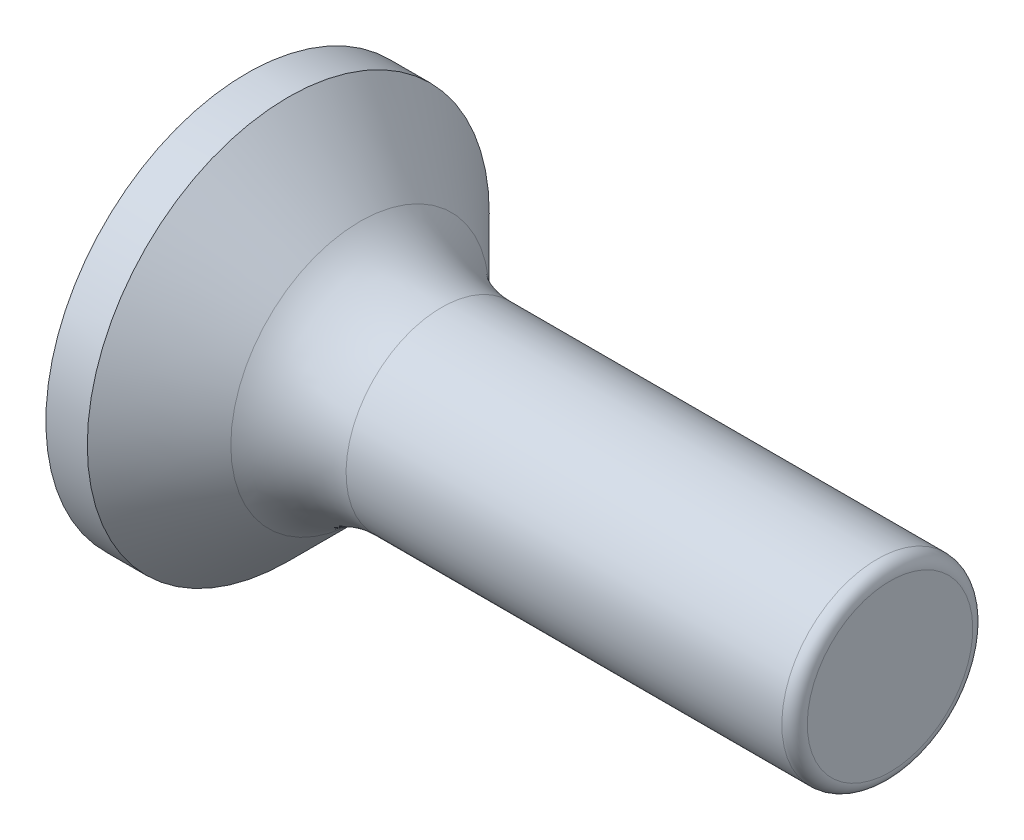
ISO-10303-21;
HEADER;
FILE_DESCRIPTION(('STEP AP214'),'2;1');
FILE_NAME('part.step','',(''),(''),'','','');
FILE_SCHEMA(('AUTOMOTIVE_DESIGN { 1 0 10303 214 1 1 1 1 }'));
ENDSEC;
DATA;
#1=APPLICATION_CONTEXT('core data for automotive mechanical design processes');
#2=APPLICATION_PROTOCOL_DEFINITION('international standard','automotive_design',2000,#1);
#3=PRODUCT_CONTEXT('',#1,'mechanical');
#4=PRODUCT('Part','Part','',(#3));
#5=PRODUCT_RELATED_PRODUCT_CATEGORY('part','',(#4));
#6=PRODUCT_DEFINITION_FORMATION('','',#4);
#7=PRODUCT_DEFINITION_CONTEXT('part definition',#1,'design');
#8=PRODUCT_DEFINITION('design','',#6,#7);
#9=PRODUCT_DEFINITION_SHAPE('','',#8);
#10=(LENGTH_UNIT() NAMED_UNIT(*) SI_UNIT(.MILLI.,.METRE.));
#11=(NAMED_UNIT(*) PLANE_ANGLE_UNIT() SI_UNIT($,.RADIAN.));
#12=(NAMED_UNIT(*) SI_UNIT($,.STERADIAN.) SOLID_ANGLE_UNIT());
#13=UNCERTAINTY_MEASURE_WITH_UNIT(LENGTH_MEASURE(1.E-05),#10,'distance_accuracy_value','');
#14=(GEOMETRIC_REPRESENTATION_CONTEXT(3) GLOBAL_UNCERTAINTY_ASSIGNED_CONTEXT((#13)) GLOBAL_UNIT_ASSIGNED_CONTEXT((#10,
#11,#12)) REPRESENTATION_CONTEXT('',''));
#15=CARTESIAN_POINT('',(0.,0.,0.));
#16=DIRECTION('',(0.,0.,1.));
#17=DIRECTION('',(1.,0.,0.));
#18=AXIS2_PLACEMENT_3D('',#15,#16,#17);
#19=CARTESIAN_POINT('',(22.8891304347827,0.,0.));
#20=DIRECTION('',(-1.,0.,0.));
#21=DIRECTION('',(0.,1.,0.));
#22=AXIS2_PLACEMENT_3D('',#19,#20,#21);
#23=SPHERICAL_SURFACE('',#22,22.8891304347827);
#24=CARTESIAN_POINT('',(2.29999999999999,0.,0.));
#25=DIRECTION('',(-1.,0.,0.));
#26=DIRECTION('',(0.,-1.,0.));
#27=AXIS2_PLACEMENT_3D('',#24,#25,#26);
#28=CIRCLE('',#27,10.);
#29=CARTESIAN_POINT('',(2.29999999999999,-10.,0.));
#30=VERTEX_POINT('',#29);
#31=EDGE_CURVE('E248',#30,#30,#28,.T.);
#32=ORIENTED_EDGE('',*,*,#31,.T.);
#33=EDGE_LOOP('',(#32));
#34=FACE_BOUND('',#33,.T.);
#35=CARTESIAN_POINT('',(22.8891304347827,0.,-1.01));
#36=DIRECTION('',(0.,0.,1.));
#37=DIRECTION('',(0.,-1.,0.));
#38=AXIS2_PLACEMENT_3D('',#35,#36,#37);
#39=CIRCLE('',#38,22.8668360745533);
#40=CARTESIAN_POINT('',(0.482999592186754,4.56700040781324,-1.01));
#41=VERTEX_POINT('',#40);
#42=CARTESIAN_POINT('',(0.0446104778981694,1.01,-1.01));
#43=VERTEX_POINT('',#42);
#44=EDGE_CURVE('E167',#41,#43,#39,.T.);
#45=ORIENTED_EDGE('',*,*,#44,.F.);
#46=CARTESIAN_POINT('',(13.9695652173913,-8.91956521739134,0.));
#47=DIRECTION('',(-0.707106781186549,-0.707106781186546,0.));
#48=DIRECTION('',(0.707106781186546,-0.707106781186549,0.));
#49=AXIS2_PLACEMENT_3D('',#46,#47,#48);
#50=CIRCLE('',#49,19.0996074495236);
#51=CARTESIAN_POINT('',(0.482999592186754,4.56700040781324,1.01));
#52=VERTEX_POINT('',#51);
#53=EDGE_CURVE('E188',#52,#41,#50,.T.);
#54=ORIENTED_EDGE('',*,*,#53,.F.);
#55=CARTESIAN_POINT('',(22.8891304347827,0.,1.01));
#56=DIRECTION('',(0.,0.,-1.));
#57=DIRECTION('',(0.,1.,0.));
#58=AXIS2_PLACEMENT_3D('',#55,#56,#57);
#59=CIRCLE('',#58,22.8668360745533);
#60=CARTESIAN_POINT('',(0.0446104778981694,1.01,1.01));
#61=VERTEX_POINT('',#60);
#62=EDGE_CURVE('E171',#61,#52,#59,.T.);
#63=ORIENTED_EDGE('',*,*,#62,.F.);
#64=CARTESIAN_POINT('',(22.8891304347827,1.01,0.));
#65=DIRECTION('',(0.,-1.,0.));
#66=DIRECTION('',(0.,0.,-1.));
#67=AXIS2_PLACEMENT_3D('',#64,#65,#66);
#68=CIRCLE('',#67,22.8668360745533);
#69=CARTESIAN_POINT('',(0.482999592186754,1.01,4.56700040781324));
#70=VERTEX_POINT('',#69);
#71=EDGE_CURVE('E163',#70,#61,#68,.T.);
#72=ORIENTED_EDGE('',*,*,#71,.F.);
#73=CARTESIAN_POINT('',(13.9695652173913,0.,-8.91956521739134));
#74=DIRECTION('',(-0.707106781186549,0.,-0.707106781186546));
#75=DIRECTION('',(-0.707106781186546,0.,0.707106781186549));
#76=AXIS2_PLACEMENT_3D('',#73,#74,#75);
#77=CIRCLE('',#76,19.0996074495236);
#78=CARTESIAN_POINT('',(0.482999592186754,-1.01,4.56700040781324));
#79=VERTEX_POINT('',#78);
#80=EDGE_CURVE('E161',#79,#70,#77,.T.);
#81=ORIENTED_EDGE('',*,*,#80,.F.);
#82=CARTESIAN_POINT('',(22.8891304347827,-1.01,0.));
#83=DIRECTION('',(0.,1.,0.));
#84=DIRECTION('',(0.,0.,1.));
#85=AXIS2_PLACEMENT_3D('',#82,#83,#84);
#86=CIRCLE('',#85,22.8668360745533);
#87=CARTESIAN_POINT('',(0.0446104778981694,-1.01,1.01));
#88=VERTEX_POINT('',#87);
#89=EDGE_CURVE('E146',#88,#79,#86,.T.);
#90=ORIENTED_EDGE('',*,*,#89,.F.);
#91=CARTESIAN_POINT('',(22.8891304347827,0.,1.01));
#92=DIRECTION('',(0.,0.,-1.));
#93=DIRECTION('',(0.,1.,0.));
#94=AXIS2_PLACEMENT_3D('',#91,#92,#93);
#95=CIRCLE('',#94,22.8668360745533);
#96=CARTESIAN_POINT('',(0.482999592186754,-4.56700040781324,1.01));
#97=VERTEX_POINT('',#96);
#98=EDGE_CURVE('E136',#97,#88,#95,.T.);
#99=ORIENTED_EDGE('',*,*,#98,.F.);
#100=CARTESIAN_POINT('',(13.9695652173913,8.91956521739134,0.));
#101=DIRECTION('',(-0.707106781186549,0.707106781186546,0.));
#102=DIRECTION('',(-0.707106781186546,-0.707106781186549,0.));
#103=AXIS2_PLACEMENT_3D('',#100,#101,#102);
#104=CIRCLE('',#103,19.0996074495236);
#105=CARTESIAN_POINT('',(0.482999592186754,-4.56700040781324,-1.01));
#106=VERTEX_POINT('',#105);
#107=EDGE_CURVE('E147',#106,#97,#104,.T.);
#108=ORIENTED_EDGE('',*,*,#107,.F.);
#109=CARTESIAN_POINT('',(22.8891304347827,0.,-1.01));
#110=DIRECTION('',(0.,0.,1.));
#111=DIRECTION('',(0.,-1.,0.));
#112=AXIS2_PLACEMENT_3D('',#109,#110,#111);
#113=CIRCLE('',#112,22.8668360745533);
#114=CARTESIAN_POINT('',(0.0446104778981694,-1.01,-1.01));
#115=VERTEX_POINT('',#114);
#116=EDGE_CURVE('E178',#115,#106,#113,.T.);
#117=ORIENTED_EDGE('',*,*,#116,.F.);
#118=CARTESIAN_POINT('',(22.8891304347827,-1.01,0.));
#119=DIRECTION('',(0.,1.,0.));
#120=DIRECTION('',(0.,0.,1.));
#121=AXIS2_PLACEMENT_3D('',#118,#119,#120);
#122=CIRCLE('',#121,22.8668360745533);
#123=CARTESIAN_POINT('',(0.482999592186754,-1.01,-4.56700040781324));
#124=VERTEX_POINT('',#123);
#125=EDGE_CURVE('E176',#124,#115,#122,.T.);
#126=ORIENTED_EDGE('',*,*,#125,.F.);
#127=CARTESIAN_POINT('',(13.9695652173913,0.,8.91956521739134));
#128=DIRECTION('',(-0.707106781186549,0.,0.707106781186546));
#129=DIRECTION('',(0.707106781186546,0.,0.707106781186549));
#130=AXIS2_PLACEMENT_3D('',#127,#128,#129);
#131=CIRCLE('',#130,19.0996074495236);
#132=CARTESIAN_POINT('',(0.482999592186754,1.01,-4.56700040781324));
#133=VERTEX_POINT('',#132);
#134=EDGE_CURVE('E174',#133,#124,#131,.T.);
#135=ORIENTED_EDGE('',*,*,#134,.F.);
#136=CARTESIAN_POINT('',(22.8891304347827,1.01,0.));
#137=DIRECTION('',(0.,-1.,0.));
#138=DIRECTION('',(0.,0.,-1.));
#139=AXIS2_PLACEMENT_3D('',#136,#137,#138);
#140=CIRCLE('',#139,22.8668360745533);
#141=EDGE_CURVE('E172',#43,#133,#140,.T.);
#142=ORIENTED_EDGE('',*,*,#141,.F.);
#143=EDGE_LOOP('',(#45,#54,#63,#72,#81,#90,#99,#108,#117,#126,#135,#142));
#144=FACE_BOUND('',#143,.T.);
#145=ADVANCED_FACE('F43',(#34,#144),#23,.T.);
#146=CARTESIAN_POINT('',(11.9851256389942,0.,0.));
#147=DIRECTION('',(-1.,0.,0.));
#148=DIRECTION('',(0.,-1.,0.));
#149=AXIS2_PLACEMENT_3D('',#146,#147,#148);
#150=TOROIDAL_SURFACE('',#149,10.48406053,5.73406053);
#151=CARTESIAN_POINT('',(7.93053255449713,0.,0.));
#152=DIRECTION('',(-1.,0.,0.));
#153=DIRECTION('',(0.,-1.,0.));
#154=AXIS2_PLACEMENT_3D('',#151,#152,#153);
#155=CIRCLE('',#154,6.42946744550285);
#156=CARTESIAN_POINT('',(7.93053255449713,-6.42946744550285,0.));
#157=VERTEX_POINT('',#156);
#158=EDGE_CURVE('E175',#157,#157,#155,.T.);
#159=ORIENTED_EDGE('',*,*,#158,.F.);
#160=EDGE_LOOP('',(#159));
#161=FACE_BOUND('',#160,.T.);
#162=CARTESIAN_POINT('',(11.9851256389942,0.,0.));
#163=DIRECTION('',(-1.,0.,0.));
#164=DIRECTION('',(0.,-1.,0.));
#165=AXIS2_PLACEMENT_3D('',#162,#163,#164);
#166=CIRCLE('',#165,4.74999999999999);
#167=CARTESIAN_POINT('',(11.9851256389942,-4.74999999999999,0.));
#168=VERTEX_POINT('',#167);
#169=EDGE_CURVE('E200',#168,#168,#166,.T.);
#170=ORIENTED_EDGE('',*,*,#169,.T.);
#171=EDGE_LOOP('',(#170));
#172=FACE_BOUND('',#171,.T.);
#173=ADVANCED_FACE('F288',(#161,#172),#150,.F.);
#174=CARTESIAN_POINT('',(7.93053255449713,0.,0.));
#175=DIRECTION('',(-1.,0.,0.));
#176=DIRECTION('',(0.,-1.,0.));
#177=AXIS2_PLACEMENT_3D('',#174,#175,#176);
#178=CONICAL_SURFACE('',#177,6.42946744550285,0.785398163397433);
#179=CARTESIAN_POINT('',(4.35999999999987,0.,0.));
#180=DIRECTION('',(-1.,0.,0.));
#181=DIRECTION('',(0.,-1.,0.));
#182=AXIS2_PLACEMENT_3D('',#179,#180,#181);
#183=CIRCLE('',#182,10.);
#184=CARTESIAN_POINT('',(4.35999999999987,-10.,0.));
#185=VERTEX_POINT('',#184);
#186=EDGE_CURVE('E251',#185,#185,#183,.T.);
#187=ORIENTED_EDGE('',*,*,#186,.F.);
#188=EDGE_LOOP('',(#187));
#189=FACE_BOUND('',#188,.T.);
#190=ORIENTED_EDGE('',*,*,#158,.T.);
#191=EDGE_LOOP('',(#190));
#192=FACE_BOUND('',#191,.T.);
#193=ADVANCED_FACE('F296',(#189,#192),#178,.T.);
#194=CARTESIAN_POINT('',(-18.0938637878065,0.,0.));
#195=DIRECTION('',(-1.,0.,0.));
#196=DIRECTION('',(0.,-1.,0.));
#197=AXIS2_PLACEMENT_3D('',#194,#195,#196);
#198=CYLINDRICAL_SURFACE('',#197,10.);
#199=ORIENTED_EDGE('',*,*,#31,.F.);
#200=EDGE_LOOP('',(#199));
#201=FACE_BOUND('',#200,.T.);
#202=ORIENTED_EDGE('',*,*,#186,.T.);
#203=EDGE_LOOP('',(#202));
#204=FACE_BOUND('',#203,.T.);
#205=ADVANCED_FACE('F303',(#201,#204),#198,.T.);
#206=CARTESIAN_POINT('',(34.3,0.,0.));
#207=DIRECTION('',(-1.,0.,0.));
#208=DIRECTION('',(0.,-1.,0.));
#209=AXIS2_PLACEMENT_3D('',#206,#207,#208);
#210=PLANE('',#209);
#211=CARTESIAN_POINT('',(34.3,0.,0.));
#212=DIRECTION('',(-1.,0.,0.));
#213=DIRECTION('',(0.,-1.,0.));
#214=AXIS2_PLACEMENT_3D('',#211,#212,#213);
#215=CIRCLE('',#214,4.11666666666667);
#216=CARTESIAN_POINT('',(34.3,-4.11666666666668,0.));
#217=VERTEX_POINT('',#216);
#218=EDGE_CURVE('E11',#217,#217,#215,.F.);
#219=ORIENTED_EDGE('',*,*,#218,.T.);
#220=EDGE_LOOP('',(#219));
#221=FACE_BOUND('',#220,.T.);
#222=ADVANCED_FACE('F301',(#221),#210,.F.);
#223=CARTESIAN_POINT('',(-18.0938637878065,0.,0.));
#224=DIRECTION('',(-1.,0.,0.));
#225=DIRECTION('',(0.,-1.,0.));
#226=AXIS2_PLACEMENT_3D('',#223,#224,#225);
#227=CYLINDRICAL_SURFACE('',#226,4.75);
#228=CARTESIAN_POINT('',(33.6666666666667,0.,0.));
#229=DIRECTION('',(-1.,0.,0.));
#230=DIRECTION('',(0.,-1.,0.));
#231=AXIS2_PLACEMENT_3D('',#228,#229,#230);
#232=CIRCLE('',#231,4.75);
#233=CARTESIAN_POINT('',(33.6666666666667,-4.75000000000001,0.));
#234=VERTEX_POINT('',#233);
#235=EDGE_CURVE('E52',#234,#234,#232,.T.);
#236=ORIENTED_EDGE('',*,*,#235,.T.);
#237=EDGE_LOOP('',(#236));
#238=FACE_BOUND('',#237,.T.);
#239=ORIENTED_EDGE('',*,*,#169,.F.);
#240=EDGE_LOOP('',(#239));
#241=FACE_BOUND('',#240,.T.);
#242=ADVANCED_FACE('F320',(#238,#241),#227,.T.);
#243=CARTESIAN_POINT('',(2.81526627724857,5.05,-1.01));
#244=DIRECTION('',(0.,0.,1.));
#245=DIRECTION('',(0.,-1.,0.));
#246=AXIS2_PLACEMENT_3D('',#243,#244,#245);
#247=PLANE('',#246);
#248=ORIENTED_EDGE('',*,*,#44,.T.);
#249=DIRECTION('',(-1.,0.,0.));
#250=VECTOR('',#249,1.);
#251=CARTESIAN_POINT('',(2.81526627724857,1.01,-1.01));
#252=LINE('',#251,#250);
#253=CARTESIAN_POINT('',(2.81526627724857,1.01,-1.01));
#254=VERTEX_POINT('',#253);
#255=EDGE_CURVE('E60',#254,#43,#252,.T.);
#256=ORIENTED_EDGE('',*,*,#255,.F.);
#257=DIRECTION('',(0.,1.,0.));
#258=VECTOR('',#257,1.);
#259=CARTESIAN_POINT('',(2.81526627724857,5.05,-1.01));
#260=LINE('',#259,#258);
#261=CARTESIAN_POINT('',(2.81526627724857,2.23473372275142,-1.01));
#262=VERTEX_POINT('',#261);
#263=EDGE_CURVE('E198',#254,#262,#260,.T.);
#264=ORIENTED_EDGE('',*,*,#263,.T.);
#265=DIRECTION('',(-0.707106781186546,0.707106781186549,0.));
#266=VECTOR('',#265,1.);
#267=CARTESIAN_POINT('',(0.,5.05,-1.01));
#268=LINE('',#267,#266);
#269=EDGE_CURVE('E193',#262,#41,#268,.T.);
#270=ORIENTED_EDGE('',*,*,#269,.T.);
#271=EDGE_LOOP('',(#248,#256,#264,#270));
#272=FACE_BOUND('',#271,.T.);
#273=ADVANCED_FACE('F223',(#272),#247,.T.);
#274=CARTESIAN_POINT('',(0.,5.05,0.));
#275=DIRECTION('',(-0.707106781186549,-0.707106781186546,0.));
#276=DIRECTION('',(0.707106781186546,-0.707106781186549,0.));
#277=AXIS2_PLACEMENT_3D('',#274,#275,#276);
#278=PLANE('',#277);
#279=ORIENTED_EDGE('',*,*,#53,.T.);
#280=ORIENTED_EDGE('',*,*,#269,.F.);
#281=DIRECTION('',(0.,0.,1.));
#282=VECTOR('',#281,1.);
#283=CARTESIAN_POINT('',(2.81526627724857,2.23473372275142,-1.01));
#284=LINE('',#283,#282);
#285=CARTESIAN_POINT('',(2.81526627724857,2.23473372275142,1.01));
#286=VERTEX_POINT('',#285);
#287=EDGE_CURVE('E195',#262,#286,#284,.T.);
#288=ORIENTED_EDGE('',*,*,#287,.T.);
#289=DIRECTION('',(-0.707106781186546,0.707106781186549,0.));
#290=VECTOR('',#289,1.);
#291=CARTESIAN_POINT('',(1.40763313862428,3.64236686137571,1.01));
#292=LINE('',#291,#290);
#293=EDGE_CURVE('E190',#286,#52,#292,.T.);
#294=ORIENTED_EDGE('',*,*,#293,.T.);
#295=EDGE_LOOP('',(#279,#280,#288,#294));
#296=FACE_BOUND('',#295,.T.);
#297=ADVANCED_FACE('F265',(#296),#278,.T.);
#298=CARTESIAN_POINT('',(2.81526627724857,5.05,1.01));
#299=DIRECTION('',(0.,0.,-1.));
#300=DIRECTION('',(0.,1.,0.));
#301=AXIS2_PLACEMENT_3D('',#298,#299,#300);
#302=PLANE('',#301);
#303=ORIENTED_EDGE('',*,*,#62,.T.);
#304=ORIENTED_EDGE('',*,*,#293,.F.);
#305=DIRECTION('',(0.,-1.,0.));
#306=VECTOR('',#305,1.);
#307=CARTESIAN_POINT('',(2.81526627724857,5.05,1.01));
#308=LINE('',#307,#306);
#309=CARTESIAN_POINT('',(2.81526627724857,1.01,1.01));
#310=VERTEX_POINT('',#309);
#311=EDGE_CURVE('E197',#286,#310,#308,.T.);
#312=ORIENTED_EDGE('',*,*,#311,.T.);
#313=DIRECTION('',(-1.,0.,0.));
#314=VECTOR('',#313,1.);
#315=CARTESIAN_POINT('',(2.81526627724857,1.01,1.01));
#316=LINE('',#315,#314);
#317=EDGE_CURVE('E194',#310,#61,#316,.T.);
#318=ORIENTED_EDGE('',*,*,#317,.T.);
#319=EDGE_LOOP('',(#303,#304,#312,#318));
#320=FACE_BOUND('',#319,.T.);
#321=ADVANCED_FACE('F260',(#320),#302,.T.);
#322=CARTESIAN_POINT('',(2.81526627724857,1.01,1.01));
#323=DIRECTION('',(0.,-1.,0.));
#324=DIRECTION('',(0.,0.,-1.));
#325=AXIS2_PLACEMENT_3D('',#322,#323,#324);
#326=PLANE('',#325);
#327=ORIENTED_EDGE('',*,*,#71,.T.);
#328=ORIENTED_EDGE('',*,*,#317,.F.);
#329=DIRECTION('',(0.,0.,1.));
#330=VECTOR('',#329,1.);
#331=CARTESIAN_POINT('',(2.81526627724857,1.01,1.01));
#332=LINE('',#331,#330);
#333=CARTESIAN_POINT('',(2.81526627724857,1.01,2.23473372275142));
#334=VERTEX_POINT('',#333);
#335=EDGE_CURVE('E206',#310,#334,#332,.T.);
#336=ORIENTED_EDGE('',*,*,#335,.T.);
#337=DIRECTION('',(-0.707106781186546,0.,0.707106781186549));
#338=VECTOR('',#337,1.);
#339=CARTESIAN_POINT('',(0.,1.01,5.05));
#340=LINE('',#339,#338);
#341=EDGE_CURVE('E203',#334,#70,#340,.T.);
#342=ORIENTED_EDGE('',*,*,#341,.T.);
#343=EDGE_LOOP('',(#327,#328,#336,#342));
#344=FACE_BOUND('',#343,.T.);
#345=ADVANCED_FACE('F313',(#344),#326,.T.);
#346=CARTESIAN_POINT('',(0.,0.,5.05));
#347=DIRECTION('',(-0.707106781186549,0.,-0.707106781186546));
#348=DIRECTION('',(-0.707106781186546,0.,0.707106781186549));
#349=AXIS2_PLACEMENT_3D('',#346,#347,#348);
#350=PLANE('',#349);
#351=ORIENTED_EDGE('',*,*,#80,.T.);
#352=ORIENTED_EDGE('',*,*,#341,.F.);
#353=DIRECTION('',(0.,-1.,0.));
#354=VECTOR('',#353,1.);
#355=CARTESIAN_POINT('',(2.81526627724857,-1.01,2.23473372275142));
#356=LINE('',#355,#354);
#357=CARTESIAN_POINT('',(2.81526627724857,-1.01,2.23473372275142));
#358=VERTEX_POINT('',#357);
#359=EDGE_CURVE('E204',#334,#358,#356,.T.);
#360=ORIENTED_EDGE('',*,*,#359,.T.);
#361=DIRECTION('',(-0.707106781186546,0.,0.707106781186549));
#362=VECTOR('',#361,1.);
#363=CARTESIAN_POINT('',(3.42763313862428,-1.01,1.62236686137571));
#364=LINE('',#363,#362);
#365=EDGE_CURVE('E156',#358,#79,#364,.T.);
#366=ORIENTED_EDGE('',*,*,#365,.T.);
#367=EDGE_LOOP('',(#351,#352,#360,#366));
#368=FACE_BOUND('',#367,.T.);
#369=ADVANCED_FACE('F311',(#368),#350,.T.);
#370=CARTESIAN_POINT('',(2.81526627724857,-1.01,1.01));
#371=DIRECTION('',(0.,1.,0.));
#372=DIRECTION('',(0.,0.,1.));
#373=AXIS2_PLACEMENT_3D('',#370,#371,#372);
#374=PLANE('',#373);
#375=ORIENTED_EDGE('',*,*,#89,.T.);
#376=ORIENTED_EDGE('',*,*,#365,.F.);
#377=DIRECTION('',(0.,0.,-1.));
#378=VECTOR('',#377,1.);
#379=CARTESIAN_POINT('',(2.81526627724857,-1.01,1.01));
#380=LINE('',#379,#378);
#381=CARTESIAN_POINT('',(2.81526627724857,-1.01,1.01));
#382=VERTEX_POINT('',#381);
#383=EDGE_CURVE('E155',#358,#382,#380,.T.);
#384=ORIENTED_EDGE('',*,*,#383,.T.);
#385=DIRECTION('',(-1.,0.,0.));
#386=VECTOR('',#385,1.);
#387=CARTESIAN_POINT('',(2.81526627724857,-1.01,1.01));
#388=LINE('',#387,#386);
#389=EDGE_CURVE('E139',#382,#88,#388,.T.);
#390=ORIENTED_EDGE('',*,*,#389,.T.);
#391=EDGE_LOOP('',(#375,#376,#384,#390));
#392=FACE_BOUND('',#391,.T.);
#393=ADVANCED_FACE('F151',(#392),#374,.T.);
#394=CARTESIAN_POINT('',(2.81526627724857,-5.05,1.01));
#395=DIRECTION('',(0.,0.,-1.));
#396=DIRECTION('',(0.,1.,0.));
#397=AXIS2_PLACEMENT_3D('',#394,#395,#396);
#398=PLANE('',#397);
#399=ORIENTED_EDGE('',*,*,#98,.T.);
#400=ORIENTED_EDGE('',*,*,#389,.F.);
#401=DIRECTION('',(0.,-1.,0.));
#402=VECTOR('',#401,1.);
#403=CARTESIAN_POINT('',(2.81526627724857,-5.05,1.01));
#404=LINE('',#403,#402);
#405=CARTESIAN_POINT('',(2.81526627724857,-2.23473372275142,1.01));
#406=VERTEX_POINT('',#405);
#407=EDGE_CURVE('E186',#382,#406,#404,.T.);
#408=ORIENTED_EDGE('',*,*,#407,.T.);
#409=DIRECTION('',(-0.707106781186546,-0.707106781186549,0.));
#410=VECTOR('',#409,1.);
#411=CARTESIAN_POINT('',(0.,-5.05,1.01));
#412=LINE('',#411,#410);
#413=EDGE_CURVE('E142',#406,#97,#412,.T.);
#414=ORIENTED_EDGE('',*,*,#413,.T.);
#415=EDGE_LOOP('',(#399,#400,#408,#414));
#416=FACE_BOUND('',#415,.T.);
#417=ADVANCED_FACE('F138',(#416),#398,.T.);
#418=CARTESIAN_POINT('',(0.,-5.05,0.));
#419=DIRECTION('',(-0.707106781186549,0.707106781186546,0.));
#420=DIRECTION('',(-0.707106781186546,-0.707106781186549,0.));
#421=AXIS2_PLACEMENT_3D('',#418,#419,#420);
#422=PLANE('',#421);
#423=ORIENTED_EDGE('',*,*,#107,.T.);
#424=ORIENTED_EDGE('',*,*,#413,.F.);
#425=DIRECTION('',(0.,0.,-1.));
#426=VECTOR('',#425,1.);
#427=CARTESIAN_POINT('',(2.81526627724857,-2.23473372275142,-1.01));
#428=LINE('',#427,#426);
#429=CARTESIAN_POINT('',(2.81526627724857,-2.23473372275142,-1.01));
#430=VERTEX_POINT('',#429);
#431=EDGE_CURVE('E184',#406,#430,#428,.T.);
#432=ORIENTED_EDGE('',*,*,#431,.T.);
#433=DIRECTION('',(-0.707106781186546,-0.707106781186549,0.));
#434=VECTOR('',#433,1.);
#435=CARTESIAN_POINT('',(1.40763313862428,-3.64236686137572,-1.01));
#436=LINE('',#435,#434);
#437=EDGE_CURVE('E180',#430,#106,#436,.T.);
#438=ORIENTED_EDGE('',*,*,#437,.T.);
#439=EDGE_LOOP('',(#423,#424,#432,#438));
#440=FACE_BOUND('',#439,.T.);
#441=ADVANCED_FACE('F274',(#440),#422,.T.);
#442=CARTESIAN_POINT('',(2.81526627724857,-5.05,-1.01));
#443=DIRECTION('',(0.,0.,1.));
#444=DIRECTION('',(0.,-1.,0.));
#445=AXIS2_PLACEMENT_3D('',#442,#443,#444);
#446=PLANE('',#445);
#447=ORIENTED_EDGE('',*,*,#116,.T.);
#448=ORIENTED_EDGE('',*,*,#437,.F.);
#449=DIRECTION('',(0.,1.,0.));
#450=VECTOR('',#449,1.);
#451=CARTESIAN_POINT('',(2.81526627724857,-5.05,-1.01));
#452=LINE('',#451,#450);
#453=CARTESIAN_POINT('',(2.81526627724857,-1.01,-1.01));
#454=VERTEX_POINT('',#453);
#455=EDGE_CURVE('E125',#430,#454,#452,.T.);
#456=ORIENTED_EDGE('',*,*,#455,.T.);
#457=DIRECTION('',(-1.,0.,0.));
#458=VECTOR('',#457,1.);
#459=CARTESIAN_POINT('',(2.81526627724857,-1.01,-1.01));
#460=LINE('',#459,#458);
#461=EDGE_CURVE('E183',#454,#115,#460,.T.);
#462=ORIENTED_EDGE('',*,*,#461,.T.);
#463=EDGE_LOOP('',(#447,#448,#456,#462));
#464=FACE_BOUND('',#463,.T.);
#465=ADVANCED_FACE('F276',(#464),#446,.T.);
#466=CARTESIAN_POINT('',(2.81526627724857,-1.01,-1.01));
#467=DIRECTION('',(0.,1.,0.));
#468=DIRECTION('',(0.,0.,1.));
#469=AXIS2_PLACEMENT_3D('',#466,#467,#468);
#470=PLANE('',#469);
#471=ORIENTED_EDGE('',*,*,#125,.T.);
#472=ORIENTED_EDGE('',*,*,#461,.F.);
#473=DIRECTION('',(0.,0.,-1.));
#474=VECTOR('',#473,1.);
#475=CARTESIAN_POINT('',(2.81526627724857,-1.01,-1.01));
#476=LINE('',#475,#474);
#477=CARTESIAN_POINT('',(2.81526627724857,-1.01,-2.23473372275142));
#478=VERTEX_POINT('',#477);
#479=EDGE_CURVE('E117',#454,#478,#476,.T.);
#480=ORIENTED_EDGE('',*,*,#479,.T.);
#481=DIRECTION('',(-0.707106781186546,0.,-0.707106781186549));
#482=VECTOR('',#481,1.);
#483=CARTESIAN_POINT('',(0.,-1.01,-5.05));
#484=LINE('',#483,#482);
#485=EDGE_CURVE('E214',#478,#124,#484,.T.);
#486=ORIENTED_EDGE('',*,*,#485,.T.);
#487=EDGE_LOOP('',(#471,#472,#480,#486));
#488=FACE_BOUND('',#487,.T.);
#489=ADVANCED_FACE('F277',(#488),#470,.T.);
#490=CARTESIAN_POINT('',(0.,0.,-5.05));
#491=DIRECTION('',(-0.707106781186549,0.,0.707106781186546));
#492=DIRECTION('',(0.707106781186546,0.,0.707106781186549));
#493=AXIS2_PLACEMENT_3D('',#490,#491,#492);
#494=PLANE('',#493);
#495=ORIENTED_EDGE('',*,*,#134,.T.);
#496=ORIENTED_EDGE('',*,*,#485,.F.);
#497=DIRECTION('',(0.,1.,0.));
#498=VECTOR('',#497,1.);
#499=CARTESIAN_POINT('',(2.81526627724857,-1.01,-2.23473372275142));
#500=LINE('',#499,#498);
#501=CARTESIAN_POINT('',(2.81526627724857,1.01,-2.23473372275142));
#502=VERTEX_POINT('',#501);
#503=EDGE_CURVE('E215',#478,#502,#500,.T.);
#504=ORIENTED_EDGE('',*,*,#503,.T.);
#505=DIRECTION('',(-0.707106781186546,0.,-0.707106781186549));
#506=VECTOR('',#505,1.);
#507=CARTESIAN_POINT('',(3.42763313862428,1.01,-1.62236686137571));
#508=LINE('',#507,#506);
#509=EDGE_CURVE('E211',#502,#133,#508,.T.);
#510=ORIENTED_EDGE('',*,*,#509,.T.);
#511=EDGE_LOOP('',(#495,#496,#504,#510));
#512=FACE_BOUND('',#511,.T.);
#513=ADVANCED_FACE('F234',(#512),#494,.T.);
#514=CARTESIAN_POINT('',(2.81526627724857,1.01,-1.01));
#515=DIRECTION('',(0.,-1.,0.));
#516=DIRECTION('',(0.,0.,-1.));
#517=AXIS2_PLACEMENT_3D('',#514,#515,#516);
#518=PLANE('',#517);
#519=ORIENTED_EDGE('',*,*,#141,.T.);
#520=ORIENTED_EDGE('',*,*,#509,.F.);
#521=DIRECTION('',(0.,0.,1.));
#522=VECTOR('',#521,1.);
#523=CARTESIAN_POINT('',(2.81526627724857,1.01,-1.01));
#524=LINE('',#523,#522);
#525=EDGE_CURVE('E217',#502,#254,#524,.T.);
#526=ORIENTED_EDGE('',*,*,#525,.T.);
#527=ORIENTED_EDGE('',*,*,#255,.T.);
#528=EDGE_LOOP('',(#519,#520,#526,#527));
#529=FACE_BOUND('',#528,.T.);
#530=ADVANCED_FACE('F231',(#529),#518,.T.);
#531=CARTESIAN_POINT('',(2.81526627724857,-1.01,-1.01));
#532=DIRECTION('',(-1.,0.,0.));
#533=DIRECTION('',(0.,0.,1.));
#534=AXIS2_PLACEMENT_3D('',#531,#532,#533);
#535=PLANE('',#534);
#536=ORIENTED_EDGE('',*,*,#263,.F.);
#537=ORIENTED_EDGE('',*,*,#525,.F.);
#538=ORIENTED_EDGE('',*,*,#503,.F.);
#539=ORIENTED_EDGE('',*,*,#479,.F.);
#540=ORIENTED_EDGE('',*,*,#455,.F.);
#541=ORIENTED_EDGE('',*,*,#431,.F.);
#542=ORIENTED_EDGE('',*,*,#407,.F.);
#543=ORIENTED_EDGE('',*,*,#383,.F.);
#544=ORIENTED_EDGE('',*,*,#359,.F.);
#545=ORIENTED_EDGE('',*,*,#335,.F.);
#546=ORIENTED_EDGE('',*,*,#311,.F.);
#547=ORIENTED_EDGE('',*,*,#287,.F.);
#548=EDGE_LOOP('',(#536,#537,#538,#539,#540,#541,#542,#543,#544,#545,#546,#547));
#549=FACE_BOUND('',#548,.T.);
#550=ADVANCED_FACE('F237',(#549),#535,.T.);
#551=CARTESIAN_POINT('',(33.6666666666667,0.,0.));
#552=DIRECTION('',(-1.,0.,0.));
#553=DIRECTION('',(0.,-1.,0.));
#554=AXIS2_PLACEMENT_3D('',#551,#552,#553);
#555=TOROIDAL_SURFACE('',#554,4.11666666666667,0.633333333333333);
#556=ORIENTED_EDGE('',*,*,#218,.F.);
#557=EDGE_LOOP('',(#556));
#558=FACE_BOUND('',#557,.T.);
#559=ORIENTED_EDGE('',*,*,#235,.F.);
#560=EDGE_LOOP('',(#559));
#561=FACE_BOUND('',#560,.T.);
#562=ADVANCED_FACE('F45',(#558,#561),#555,.T.);
#563=CLOSED_SHELL('',(#145,#173,#193,#205,#222,#242,#273,#297,#321,#345,#369,#393,#417,#441,
#465,#489,#513,#530,#550,#562));
#564=MANIFOLD_SOLID_BREP('B2',#563);
#565=ADVANCED_BREP_SHAPE_REPRESENTATION('',(#18,#564),#14);
#566=SHAPE_DEFINITION_REPRESENTATION(#9,#565);
ENDSEC;
END-ISO-10303-21;
